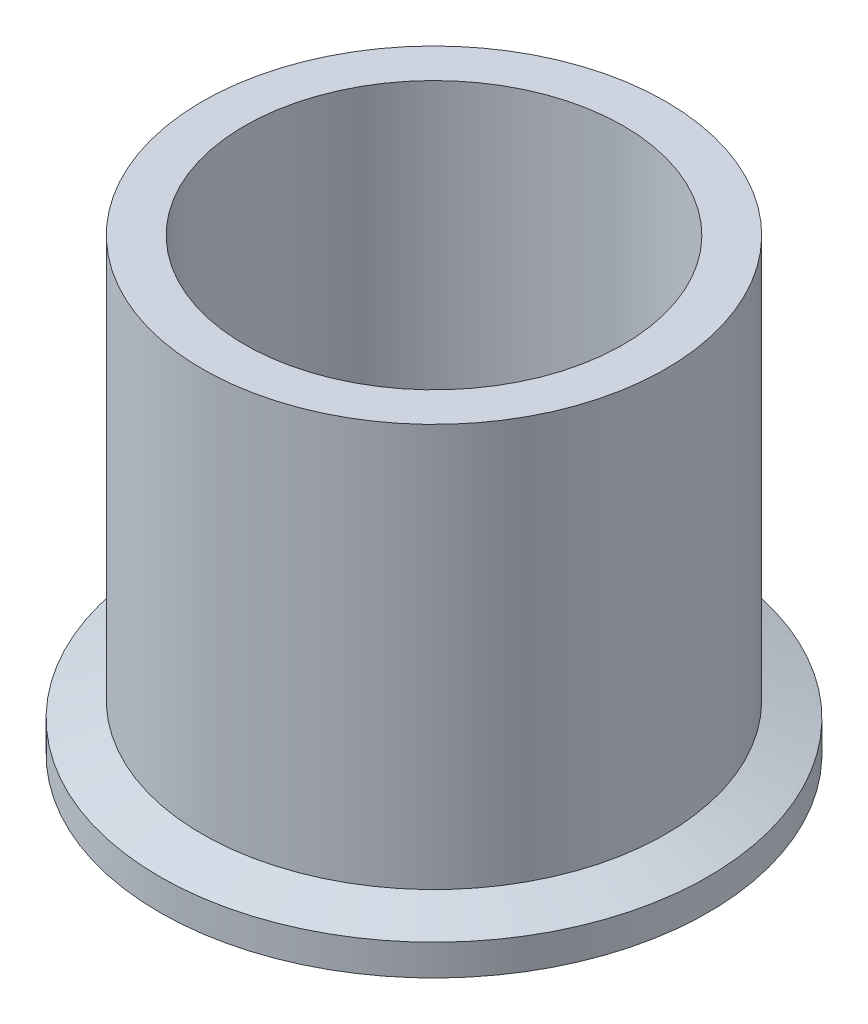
ISO-10303-21;
HEADER;
FILE_DESCRIPTION(('STEP AP214'),'2;1');
FILE_NAME('part.step','',(''),(''),'','','');
FILE_SCHEMA(('AUTOMOTIVE_DESIGN { 1 0 10303 214 1 1 1 1 }'));
ENDSEC;
DATA;
#1=APPLICATION_CONTEXT('core data for automotive mechanical design processes');
#2=APPLICATION_PROTOCOL_DEFINITION('international standard','automotive_design',2000,#1);
#3=PRODUCT_CONTEXT('',#1,'mechanical');
#4=PRODUCT('Part','Part','',(#3));
#5=PRODUCT_RELATED_PRODUCT_CATEGORY('part','',(#4));
#6=PRODUCT_DEFINITION_FORMATION('','',#4);
#7=PRODUCT_DEFINITION_CONTEXT('part definition',#1,'design');
#8=PRODUCT_DEFINITION('design','',#6,#7);
#9=PRODUCT_DEFINITION_SHAPE('','',#8);
#10=(LENGTH_UNIT() NAMED_UNIT(*) SI_UNIT(.MILLI.,.METRE.));
#11=(NAMED_UNIT(*) PLANE_ANGLE_UNIT() SI_UNIT($,.RADIAN.));
#12=(NAMED_UNIT(*) SI_UNIT($,.STERADIAN.) SOLID_ANGLE_UNIT());
#13=UNCERTAINTY_MEASURE_WITH_UNIT(LENGTH_MEASURE(1.E-05),#10,'distance_accuracy_value','');
#14=(GEOMETRIC_REPRESENTATION_CONTEXT(3) GLOBAL_UNCERTAINTY_ASSIGNED_CONTEXT((#13)) GLOBAL_UNIT_ASSIGNED_CONTEXT((#10,
#11,#12)) REPRESENTATION_CONTEXT('',''));
#15=CARTESIAN_POINT('',(0.,0.,0.));
#16=DIRECTION('',(0.,0.,1.));
#17=DIRECTION('',(1.,0.,0.));
#18=AXIS2_PLACEMENT_3D('',#15,#16,#17);
#19=CARTESIAN_POINT('',(0.,0.7874,0.));
#20=DIRECTION('',(0.,-1.,0.));
#21=DIRECTION('',(0.,0.,-1.));
#22=AXIS2_PLACEMENT_3D('',#19,#20,#21);
#23=TOROIDAL_SURFACE('',#22,23.6366084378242,0.787399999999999);
#24=CARTESIAN_POINT('',(0.,0.,0.));
#25=DIRECTION('',(0.,-1.,0.));
#26=DIRECTION('',(0.,0.,-1.));
#27=AXIS2_PLACEMENT_3D('',#24,#25,#26);
#28=CIRCLE('',#27,23.6366084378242);
#29=CARTESIAN_POINT('',(0.,0.,-23.6366084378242));
#30=VERTEX_POINT('',#29);
#31=EDGE_CURVE('E67',#30,#30,#28,.T.);
#32=ORIENTED_EDGE('',*,*,#31,.T.);
#33=EDGE_LOOP('',(#32));
#34=FACE_BOUND('',#33,.T.);
#35=CARTESIAN_POINT('',(0.,0.474458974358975,0.));
#36=DIRECTION('',(0.,-1.,0.));
#37=DIRECTION('',(0.,0.,-1.));
#38=AXIS2_PLACEMENT_3D('',#35,#36,#37);
#39=CIRCLE('',#38,22.9140666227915);
#40=CARTESIAN_POINT('',(0.,0.474458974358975,-22.9140666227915));
#41=VERTEX_POINT('',#40);
#42=EDGE_CURVE('E10',#41,#41,#39,.T.);
#43=ORIENTED_EDGE('',*,*,#42,.F.);
#44=EDGE_LOOP('',(#43));
#45=FACE_BOUND('',#44,.T.);
#46=ADVANCED_FACE('F33',(#34,#45),#23,.T.);
#47=CARTESIAN_POINT('',(0.,0.,0.));
#48=DIRECTION('',(0.,-1.,0.));
#49=DIRECTION('',(0.,0.,-1.));
#50=AXIS2_PLACEMENT_3D('',#47,#48,#49);
#51=TOROIDAL_SURFACE('',#50,21.8186,1.1938);
#52=CARTESIAN_POINT('',(0.,0.474458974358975,0.));
#53=DIRECTION('',(0.,-1.,0.));
#54=DIRECTION('',(0.,0.,-1.));
#55=AXIS2_PLACEMENT_3D('',#52,#53,#54);
#56=CIRCLE('',#55,20.7231333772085);
#57=CARTESIAN_POINT('',(0.,0.474458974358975,-20.7231333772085));
#58=VERTEX_POINT('',#57);
#59=EDGE_CURVE('E39',#58,#58,#56,.T.);
#60=ORIENTED_EDGE('',*,*,#59,.F.);
#61=EDGE_LOOP('',(#60));
#62=FACE_BOUND('',#61,.T.);
#63=ORIENTED_EDGE('',*,*,#42,.T.);
#64=EDGE_LOOP('',(#63));
#65=FACE_BOUND('',#64,.T.);
#66=ADVANCED_FACE('F115',(#62,#65),#51,.F.);
#67=CARTESIAN_POINT('',(0.,0.787400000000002,0.));
#68=DIRECTION('',(0.,-1.,0.));
#69=DIRECTION('',(0.,0.,-1.));
#70=AXIS2_PLACEMENT_3D('',#67,#68,#69);
#71=TOROIDAL_SURFACE('',#70,20.0005915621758,0.787399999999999);
#72=ORIENTED_EDGE('',*,*,#59,.T.);
#73=EDGE_LOOP('',(#72));
#74=FACE_BOUND('',#73,.T.);
#75=CARTESIAN_POINT('',(0.,0.,0.));
#76=DIRECTION('',(0.,-1.,0.));
#77=DIRECTION('',(0.,0.,-1.));
#78=AXIS2_PLACEMENT_3D('',#75,#76,#77);
#79=CIRCLE('',#78,20.0005915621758);
#80=CARTESIAN_POINT('',(0.,0.,-20.0005915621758));
#81=VERTEX_POINT('',#80);
#82=EDGE_CURVE('E43',#81,#81,#79,.T.);
#83=ORIENTED_EDGE('',*,*,#82,.F.);
#84=EDGE_LOOP('',(#83));
#85=FACE_BOUND('',#84,.T.);
#86=ADVANCED_FACE('F111',(#74,#85),#71,.T.);
#87=CARTESIAN_POINT('',(0.,0.,0.));
#88=DIRECTION('',(0.,1.,0.));
#89=DIRECTION('',(0.,0.,1.));
#90=AXIS2_PLACEMENT_3D('',#87,#88,#89);
#91=PLANE('',#90);
#92=CARTESIAN_POINT('',(0.,0.,0.));
#93=DIRECTION('',(0.,-1.,0.));
#94=DIRECTION('',(0.,0.,-1.));
#95=AXIS2_PLACEMENT_3D('',#92,#93,#94);
#96=CIRCLE('',#95,17.399);
#97=CARTESIAN_POINT('',(0.,0.,-17.399));
#98=VERTEX_POINT('',#97);
#99=EDGE_CURVE('E47',#98,#98,#96,.T.);
#100=ORIENTED_EDGE('',*,*,#99,.F.);
#101=EDGE_LOOP('',(#100));
#102=FACE_BOUND('',#101,.T.);
#103=ORIENTED_EDGE('',*,*,#82,.T.);
#104=EDGE_LOOP('',(#103));
#105=FACE_BOUND('',#104,.T.);
#106=ADVANCED_FACE('F105',(#102,#105),#91,.F.);
#107=CARTESIAN_POINT('',(0.,0.,0.));
#108=DIRECTION('',(0.,-1.,0.));
#109=DIRECTION('',(0.,0.,-1.));
#110=AXIS2_PLACEMENT_3D('',#107,#108,#109);
#111=CYLINDRICAL_SURFACE('',#110,17.399);
#112=ORIENTED_EDGE('',*,*,#99,.T.);
#113=EDGE_LOOP('',(#112));
#114=FACE_BOUND('',#113,.T.);
#115=CARTESIAN_POINT('',(0.,41.275,0.));
#116=DIRECTION('',(0.,-1.,0.));
#117=DIRECTION('',(0.,0.,-1.));
#118=AXIS2_PLACEMENT_3D('',#115,#116,#117);
#119=CIRCLE('',#118,17.399);
#120=CARTESIAN_POINT('',(0.,41.275,-17.399));
#121=VERTEX_POINT('',#120);
#122=EDGE_CURVE('E52',#121,#121,#119,.T.);
#123=ORIENTED_EDGE('',*,*,#122,.F.);
#124=EDGE_LOOP('',(#123));
#125=FACE_BOUND('',#124,.T.);
#126=ADVANCED_FACE('F100',(#114,#125),#111,.F.);
#127=CARTESIAN_POINT('',(0.,41.275,0.));
#128=DIRECTION('',(0.,-1.,0.));
#129=DIRECTION('',(0.,0.,-1.));
#130=AXIS2_PLACEMENT_3D('',#127,#128,#129);
#131=PLANE('',#130);
#132=CARTESIAN_POINT('',(0.,41.275,0.));
#133=DIRECTION('',(0.,-1.,0.));
#134=DIRECTION('',(0.,0.,-1.));
#135=AXIS2_PLACEMENT_3D('',#132,#133,#134);
#136=CIRCLE('',#135,21.2852);
#137=CARTESIAN_POINT('',(0.,41.275,-21.2852));
#138=VERTEX_POINT('',#137);
#139=EDGE_CURVE('E55',#138,#138,#136,.T.);
#140=ORIENTED_EDGE('',*,*,#139,.F.);
#141=EDGE_LOOP('',(#140));
#142=FACE_BOUND('',#141,.T.);
#143=ORIENTED_EDGE('',*,*,#122,.T.);
#144=EDGE_LOOP('',(#143));
#145=FACE_BOUND('',#144,.T.);
#146=ADVANCED_FACE('F94',(#142,#145),#131,.F.);
#147=CARTESIAN_POINT('',(0.,0.,0.));
#148=DIRECTION('',(0.,-1.,0.));
#149=DIRECTION('',(0.,0.,-1.));
#150=AXIS2_PLACEMENT_3D('',#147,#148,#149);
#151=CYLINDRICAL_SURFACE('',#150,21.2852);
#152=CARTESIAN_POINT('',(0.,4.26850596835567,0.));
#153=DIRECTION('',(0.,-1.,0.));
#154=DIRECTION('',(0.,0.,-1.));
#155=AXIS2_PLACEMENT_3D('',#152,#153,#154);
#156=CIRCLE('',#155,21.2852);
#157=CARTESIAN_POINT('',(0.,4.26850596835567,-21.2852));
#158=VERTEX_POINT('',#157);
#159=EDGE_CURVE('E58',#158,#158,#156,.T.);
#160=ORIENTED_EDGE('',*,*,#159,.F.);
#161=EDGE_LOOP('',(#160));
#162=FACE_BOUND('',#161,.T.);
#163=ORIENTED_EDGE('',*,*,#139,.T.);
#164=EDGE_LOOP('',(#163));
#165=FACE_BOUND('',#164,.T.);
#166=ADVANCED_FACE('F88',(#162,#165),#151,.T.);
#167=CARTESIAN_POINT('',(0.,4.26850596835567,0.));
#168=DIRECTION('',(0.,-1.,0.));
#169=DIRECTION('',(0.,0.,-1.));
#170=AXIS2_PLACEMENT_3D('',#167,#168,#169);
#171=CONICAL_SURFACE('',#170,21.2852,1.22173047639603);
#172=CARTESIAN_POINT('',(0.,2.8448,0.));
#173=DIRECTION('',(0.,-1.,0.));
#174=DIRECTION('',(0.,0.,-1.));
#175=AXIS2_PLACEMENT_3D('',#172,#173,#174);
#176=CIRCLE('',#175,25.1968);
#177=CARTESIAN_POINT('',(0.,2.8448,-25.1968));
#178=VERTEX_POINT('',#177);
#179=EDGE_CURVE('E61',#178,#178,#176,.T.);
#180=ORIENTED_EDGE('',*,*,#179,.F.);
#181=EDGE_LOOP('',(#180));
#182=FACE_BOUND('',#181,.T.);
#183=ORIENTED_EDGE('',*,*,#159,.T.);
#184=EDGE_LOOP('',(#183));
#185=FACE_BOUND('',#184,.T.);
#186=ADVANCED_FACE('F82',(#182,#185),#171,.T.);
#187=CARTESIAN_POINT('',(0.,0.,0.));
#188=DIRECTION('',(0.,-1.,0.));
#189=DIRECTION('',(0.,0.,-1.));
#190=AXIS2_PLACEMENT_3D('',#187,#188,#189);
#191=CYLINDRICAL_SURFACE('',#190,25.1968);
#192=CARTESIAN_POINT('',(0.,0.,0.));
#193=DIRECTION('',(0.,-1.,0.));
#194=DIRECTION('',(0.,0.,-1.));
#195=AXIS2_PLACEMENT_3D('',#192,#193,#194);
#196=CIRCLE('',#195,25.1968);
#197=CARTESIAN_POINT('',(0.,0.,-25.1968));
#198=VERTEX_POINT('',#197);
#199=EDGE_CURVE('E64',#198,#198,#196,.T.);
#200=ORIENTED_EDGE('',*,*,#199,.F.);
#201=EDGE_LOOP('',(#200));
#202=FACE_BOUND('',#201,.T.);
#203=ORIENTED_EDGE('',*,*,#179,.T.);
#204=EDGE_LOOP('',(#203));
#205=FACE_BOUND('',#204,.T.);
#206=ADVANCED_FACE('F76',(#202,#205),#191,.T.);
#207=CARTESIAN_POINT('',(0.,0.,0.));
#208=DIRECTION('',(0.,1.,0.));
#209=DIRECTION('',(0.,0.,1.));
#210=AXIS2_PLACEMENT_3D('',#207,#208,#209);
#211=PLANE('',#210);
#212=ORIENTED_EDGE('',*,*,#31,.F.);
#213=EDGE_LOOP('',(#212));
#214=FACE_BOUND('',#213,.T.);
#215=ORIENTED_EDGE('',*,*,#199,.T.);
#216=EDGE_LOOP('',(#215));
#217=FACE_BOUND('',#216,.T.);
#218=ADVANCED_FACE('F73',(#214,#217),#211,.F.);
#219=CLOSED_SHELL('',(#46,#66,#86,#106,#126,#146,#166,#186,#206,#218));
#220=MANIFOLD_SOLID_BREP('B2',#219);
#221=ADVANCED_BREP_SHAPE_REPRESENTATION('',(#18,#220),#14);
#222=SHAPE_DEFINITION_REPRESENTATION(#9,#221);
ENDSEC;
END-ISO-10303-21;
